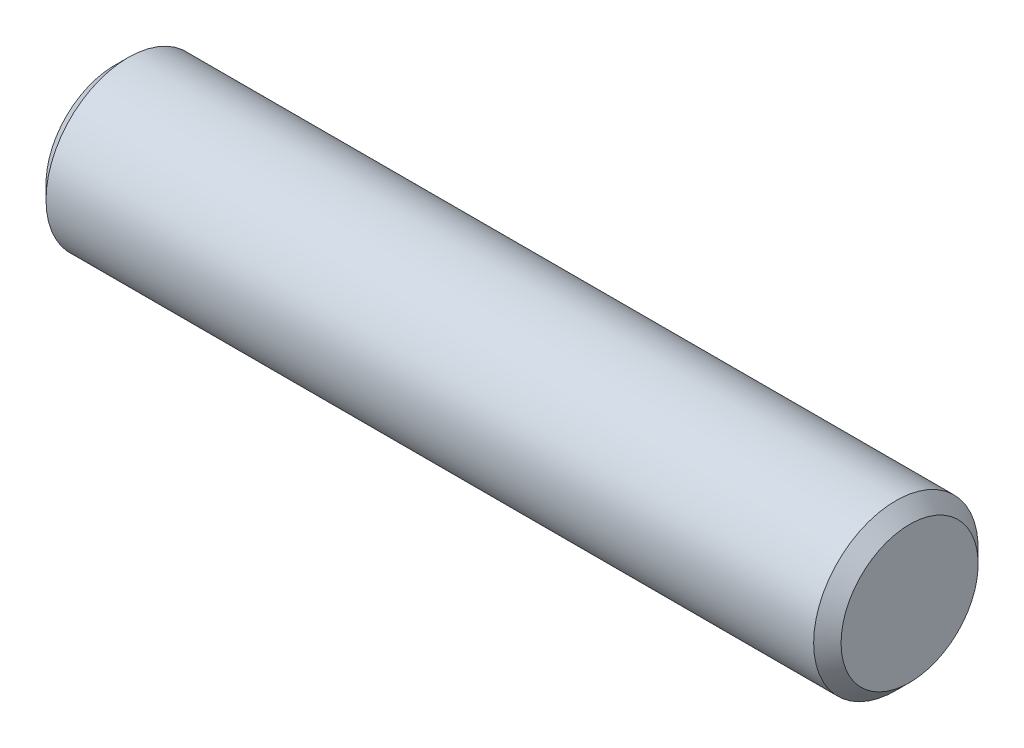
ISO-10303-21;
HEADER;
FILE_DESCRIPTION(('STEP AP214'),'2;1');
FILE_NAME('part.step','',(''),(''),'','','');
FILE_SCHEMA(('AUTOMOTIVE_DESIGN { 1 0 10303 214 1 1 1 1 }'));
ENDSEC;
DATA;
#1=APPLICATION_CONTEXT('core data for automotive mechanical design processes');
#2=APPLICATION_PROTOCOL_DEFINITION('international standard','automotive_design',2000,#1);
#3=PRODUCT_CONTEXT('',#1,'mechanical');
#4=PRODUCT('Part','Part','',(#3));
#5=PRODUCT_RELATED_PRODUCT_CATEGORY('part','',(#4));
#6=PRODUCT_DEFINITION_FORMATION('','',#4);
#7=PRODUCT_DEFINITION_CONTEXT('part definition',#1,'design');
#8=PRODUCT_DEFINITION('design','',#6,#7);
#9=PRODUCT_DEFINITION_SHAPE('','',#8);
#10=(LENGTH_UNIT() NAMED_UNIT(*) SI_UNIT(.MILLI.,.METRE.));
#11=(NAMED_UNIT(*) PLANE_ANGLE_UNIT() SI_UNIT($,.RADIAN.));
#12=(NAMED_UNIT(*) SI_UNIT($,.STERADIAN.) SOLID_ANGLE_UNIT());
#13=UNCERTAINTY_MEASURE_WITH_UNIT(LENGTH_MEASURE(1.E-05),#10,'distance_accuracy_value','');
#14=(GEOMETRIC_REPRESENTATION_CONTEXT(3) GLOBAL_UNCERTAINTY_ASSIGNED_CONTEXT((#13)) GLOBAL_UNIT_ASSIGNED_CONTEXT((#10,
#11,#12)) REPRESENTATION_CONTEXT('',''));
#15=CARTESIAN_POINT('',(0.,0.,0.));
#16=DIRECTION('',(0.,0.,1.));
#17=DIRECTION('',(1.,0.,0.));
#18=AXIS2_PLACEMENT_3D('',#15,#16,#17);
#19=CARTESIAN_POINT('',(8.67811660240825,14.1534057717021,6.66133814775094E-13));
#20=DIRECTION('',(-1.,0.,0.));
#21=DIRECTION('',(0.,0.,0.999999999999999));
#22=AXIS2_PLACEMENT_3D('',#19,#20,#21);
#23=PLANE('',#22);
#24=CARTESIAN_POINT('',(8.67811660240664,11.1534057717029,-2.22044604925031E-13));
#25=DIRECTION('',(-1.,0.,0.));
#26=DIRECTION('',(0.,0.,0.999999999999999));
#27=AXIS2_PLACEMENT_3D('',#24,#25,#26);
#28=CIRCLE('',#27,2.49999999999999);
#29=CARTESIAN_POINT('',(8.67811660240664,11.1534057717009,2.50000000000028));
#30=VERTEX_POINT('',#29);
#31=EDGE_CURVE('E40',#30,#30,#28,.F.);
#32=ORIENTED_EDGE('',*,*,#31,.T.);
#33=EDGE_LOOP('',(#32));
#34=FACE_BOUND('',#33,.T.);
#35=ADVANCED_FACE('F34',(#34),#23,.F.);
#36=CARTESIAN_POINT('',(-42.2506133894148,11.1534057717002,1.99840144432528E-12));
#37=DIRECTION('',(-1.,0.,0.));
#38=DIRECTION('',(0.,0.,0.999999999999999));
#39=AXIS2_PLACEMENT_3D('',#36,#37,#38);
#40=CYLINDRICAL_SURFACE('',#39,3.);
#41=CARTESIAN_POINT('',(8.17811660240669,11.1534057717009,2.22044604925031E-13));
#42=DIRECTION('',(-1.,0.,0.));
#43=DIRECTION('',(0.,0.,0.999999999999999));
#44=AXIS2_PLACEMENT_3D('',#41,#42,#43);
#45=CIRCLE('',#44,3.);
#46=CARTESIAN_POINT('',(8.17811660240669,11.1534057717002,3.000000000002));
#47=VERTEX_POINT('',#46);
#48=EDGE_CURVE('E44',#47,#47,#45,.T.);
#49=CARTESIAN_POINT('',(-19.8218833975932,11.153405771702,2.22044604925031E-13));
#50=DIRECTION('',(1.,0.,0.));
#51=DIRECTION('',(0.,0.,-0.999999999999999));
#52=AXIS2_PLACEMENT_3D('',#49,#50,#51);
#53=CIRCLE('',#52,3.);
#54=CARTESIAN_POINT('',(-19.8218833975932,11.1534057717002,3.000000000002));
#55=VERTEX_POINT('',#54);
#56=EDGE_CURVE('E48',#55,#55,#53,.T.);
#57=CARTESIAN_POINT('',(8.17811660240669,11.1534057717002,3.000000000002));
#58=CARTESIAN_POINT('',(7.88644993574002,11.1534057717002,3.000000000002));
#59=CARTESIAN_POINT('',(7.59478326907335,11.1534057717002,3.000000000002));
#60=CARTESIAN_POINT('',(7.01144993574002,11.1534057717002,3.000000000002));
#61=CARTESIAN_POINT('',(6.71978326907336,11.1534057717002,3.000000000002));
#62=CARTESIAN_POINT('',(6.13644993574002,11.1534057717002,3.000000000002));
#63=CARTESIAN_POINT('',(5.84478326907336,11.1534057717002,3.000000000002));
#64=CARTESIAN_POINT('',(5.26144993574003,11.1534057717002,3.000000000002));
#65=CARTESIAN_POINT('',(4.96978326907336,11.1534057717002,3.000000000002));
#66=CARTESIAN_POINT('',(4.38644993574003,11.1534057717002,3.000000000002));
#67=CARTESIAN_POINT('',(4.09478326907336,11.1534057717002,3.000000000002));
#68=CARTESIAN_POINT('',(3.51144993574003,11.1534057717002,3.000000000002));
#69=CARTESIAN_POINT('',(3.21978326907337,11.1534057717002,3.000000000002));
#70=CARTESIAN_POINT('',(2.63644993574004,11.1534057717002,3.000000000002));
#71=CARTESIAN_POINT('',(2.34478326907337,11.1534057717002,3.000000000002));
#72=CARTESIAN_POINT('',(1.76144993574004,11.1534057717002,3.000000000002));
#73=CARTESIAN_POINT('',(1.46978326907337,11.1534057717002,3.000000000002));
#74=CARTESIAN_POINT('',(0.886449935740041,11.1534057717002,3.000000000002));
#75=CARTESIAN_POINT('',(0.594783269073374,11.1534057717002,3.000000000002));
#76=CARTESIAN_POINT('',(0.0114499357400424,11.1534057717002,3.000000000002));
#77=CARTESIAN_POINT('',(-0.280216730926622,11.1534057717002,3.000000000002));
#78=CARTESIAN_POINT('',(-0.863550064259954,11.1534057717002,3.000000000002));
#79=CARTESIAN_POINT('',(-1.15521673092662,11.1534057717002,3.000000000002));
#80=CARTESIAN_POINT('',(-1.73855006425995,11.1534057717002,3.000000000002));
#81=CARTESIAN_POINT('',(-2.03021673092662,11.1534057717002,3.000000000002));
#82=CARTESIAN_POINT('',(-2.61355006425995,11.1534057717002,3.000000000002));
#83=CARTESIAN_POINT('',(-2.90521673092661,11.1534057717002,3.000000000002));
#84=CARTESIAN_POINT('',(-3.48855006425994,11.1534057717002,3.000000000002));
#85=CARTESIAN_POINT('',(-3.78021673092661,11.1534057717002,3.000000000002));
#86=CARTESIAN_POINT('',(-4.36355006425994,11.1534057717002,3.000000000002));
#87=CARTESIAN_POINT('',(-4.6552167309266,11.1534057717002,3.000000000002));
#88=CARTESIAN_POINT('',(-5.23855006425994,11.1534057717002,3.000000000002));
#89=CARTESIAN_POINT('',(-5.5302167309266,11.1534057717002,3.000000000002));
#90=CARTESIAN_POINT('',(-6.11355006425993,11.1534057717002,3.000000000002));
#91=CARTESIAN_POINT('',(-6.4052167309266,11.1534057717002,3.000000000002));
#92=CARTESIAN_POINT('',(-6.98855006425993,11.1534057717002,3.000000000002));
#93=CARTESIAN_POINT('',(-7.2802167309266,11.1534057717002,3.000000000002));
#94=CARTESIAN_POINT('',(-7.86355006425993,11.1534057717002,3.000000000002));
#95=CARTESIAN_POINT('',(-8.1552167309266,11.1534057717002,3.000000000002));
#96=CARTESIAN_POINT('',(-8.73855006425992,11.1534057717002,3.000000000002));
#97=CARTESIAN_POINT('',(-9.03021673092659,11.1534057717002,3.000000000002));
#98=CARTESIAN_POINT('',(-9.61355006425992,11.1534057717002,3.000000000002));
#99=CARTESIAN_POINT('',(-9.90521673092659,11.1534057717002,3.000000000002));
#100=CARTESIAN_POINT('',(-10.4885500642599,11.1534057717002,3.000000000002));
#101=CARTESIAN_POINT('',(-10.7802167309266,11.1534057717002,3.000000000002));
#102=CARTESIAN_POINT('',(-11.3635500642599,11.1534057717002,3.000000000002));
#103=CARTESIAN_POINT('',(-11.6552167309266,11.1534057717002,3.000000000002));
#104=CARTESIAN_POINT('',(-12.2385500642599,11.1534057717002,3.000000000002));
#105=CARTESIAN_POINT('',(-12.5302167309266,11.1534057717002,3.000000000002));
#106=CARTESIAN_POINT('',(-13.1135500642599,11.1534057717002,3.000000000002));
#107=CARTESIAN_POINT('',(-13.4052167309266,11.1534057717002,3.000000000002));
#108=CARTESIAN_POINT('',(-13.9885500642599,11.1534057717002,3.000000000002));
#109=CARTESIAN_POINT('',(-14.2802167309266,11.1534057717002,3.000000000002));
#110=CARTESIAN_POINT('',(-14.8635500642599,11.1534057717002,3.000000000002));
#111=CARTESIAN_POINT('',(-15.1552167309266,11.1534057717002,3.000000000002));
#112=CARTESIAN_POINT('',(-15.7385500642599,11.1534057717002,3.000000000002));
#113=CARTESIAN_POINT('',(-16.0302167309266,11.1534057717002,3.000000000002));
#114=CARTESIAN_POINT('',(-16.6135500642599,11.1534057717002,3.000000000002));
#115=CARTESIAN_POINT('',(-16.9052167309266,11.1534057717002,3.000000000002));
#116=CARTESIAN_POINT('',(-17.4885500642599,11.1534057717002,3.000000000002));
#117=CARTESIAN_POINT('',(-17.7802167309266,11.1534057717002,3.000000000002));
#118=CARTESIAN_POINT('',(-18.3635500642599,11.1534057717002,3.000000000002));
#119=CARTESIAN_POINT('',(-18.6552167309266,11.1534057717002,3.000000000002));
#120=CARTESIAN_POINT('',(-19.2385500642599,11.1534057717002,3.000000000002));
#121=CARTESIAN_POINT('',(-19.5302167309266,11.1534057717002,3.000000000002));
#122=CARTESIAN_POINT('',(-19.8218833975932,11.1534057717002,3.000000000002));
#123=B_SPLINE_CURVE_WITH_KNOTS('',3,(#57,#58,#59,#60,#61,#62,#63,#64,#65,#66,#67,#68,#69,#70,
#71,#72,#73,#74,#75,#76,#77,#78,#79,#80,#81,#82,#83,#84,#85,#86,#87,#88,#89,#90,#91,#92,#93,#94,
#95,#96,#97,#98,#99,#100,#101,#102,#103,#104,#105,#106,#107,#108,#109,#110,#111,#112,#113,#114,
#115,#116,#117,#118,#119,#120,#121,#122),.UNSPECIFIED.,.F.,.F.,(4,2,2,2,2,2,2,2,2,2,2,2,2,2,2,2,
2,2,2,2,2,2,2,2,2,2,2,2,2,2,2,2,4),(0.,0.875000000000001,1.74999999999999,2.625,
3.49999999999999,4.37499999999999,5.24999999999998,6.12499999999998,6.99999999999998,
7.87499999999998,8.74999999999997,9.62499999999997,10.5,11.375,12.25,13.125,14.,14.875,15.75,
16.6249999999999,17.4999999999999,18.3749999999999,19.2499999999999,20.1249999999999,
20.9999999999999,21.8749999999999,22.7499999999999,23.6249999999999,24.4999999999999,
25.3749999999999,26.2499999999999,27.1249999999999,27.9999999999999),.UNSPECIFIED.);
#124=EDGE_CURVE('BSEAM57',#47,#55,#123,.T.);
#125=ORIENTED_EDGE('',*,*,#48,.T.);
#126=ORIENTED_EDGE('',*,*,#56,.T.);
#127=ORIENTED_EDGE('',*,*,#124,.T.);
#128=ORIENTED_EDGE('',*,*,#124,.F.);
#129=EDGE_LOOP('',(#125,#127,#126,#128));
#130=FACE_BOUND('',#129,.T.);
#131=ADVANCED_FACE('F57',(#130),#40,.T.);
#132=CARTESIAN_POINT('',(-20.3218833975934,11.1534057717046,2.22044604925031E-12));
#133=DIRECTION('',(1.,0.,0.));
#134=DIRECTION('',(0.,0.,-0.999999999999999));
#135=AXIS2_PLACEMENT_3D('',#132,#133,#134);
#136=PLANE('',#135);
#137=CARTESIAN_POINT('',(-20.3218833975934,11.1534057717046,2.22044604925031E-12));
#138=DIRECTION('',(1.,0.,0.));
#139=DIRECTION('',(0.,0.,-0.999999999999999));
#140=AXIS2_PLACEMENT_3D('',#137,#138,#139);
#141=CIRCLE('',#140,2.50000000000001);
#142=CARTESIAN_POINT('',(-20.3218833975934,11.1534057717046,-2.49999999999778));
#143=VERTEX_POINT('',#142);
#144=EDGE_CURVE('E10',#143,#143,#141,.F.);
#145=ORIENTED_EDGE('',*,*,#144,.T.);
#146=EDGE_LOOP('',(#145));
#147=FACE_BOUND('',#146,.T.);
#148=ADVANCED_FACE('F67',(#147),#136,.F.);
#149=CARTESIAN_POINT('',(8.17811660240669,11.1534057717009,2.22044604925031E-13));
#150=DIRECTION('',(-1.,0.,0.));
#151=DIRECTION('',(0.,0.,0.999999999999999));
#152=AXIS2_PLACEMENT_3D('',#149,#150,#151);
#153=CONICAL_SURFACE('',#152,3.,0.785398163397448);
#154=CARTESIAN_POINT('',(8.67811660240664,11.1534057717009,2.50000000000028));
#155=CARTESIAN_POINT('',(8.67290826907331,11.1534057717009,2.50520833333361));
#156=CARTESIAN_POINT('',(8.66769993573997,11.1534057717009,2.51041666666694));
#157=CARTESIAN_POINT('',(8.65728326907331,11.1534057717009,2.52083333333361));
#158=CARTESIAN_POINT('',(8.65207493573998,11.1534057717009,2.52604166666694));
#159=CARTESIAN_POINT('',(8.64165826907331,11.1534057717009,2.5364583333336));
#160=CARTESIAN_POINT('',(8.63644993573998,11.1534057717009,2.54166666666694));
#161=CARTESIAN_POINT('',(8.62603326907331,11.1534057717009,2.5520833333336));
#162=CARTESIAN_POINT('',(8.62082493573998,11.1534057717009,2.55729166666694));
#163=CARTESIAN_POINT('',(8.61040826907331,11.1534057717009,2.5677083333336));
#164=CARTESIAN_POINT('',(8.60519993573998,11.1534057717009,2.57291666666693));
#165=CARTESIAN_POINT('',(8.59478326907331,11.1534057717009,2.5833333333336));
#166=CARTESIAN_POINT('',(8.58957493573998,11.1534057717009,2.58854166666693));
#167=CARTESIAN_POINT('',(8.57915826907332,11.1534057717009,2.5989583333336));
#168=CARTESIAN_POINT('',(8.57394993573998,11.1534057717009,2.60416666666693));
#169=CARTESIAN_POINT('',(8.56353326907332,11.1534057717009,2.6145833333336));
#170=CARTESIAN_POINT('',(8.55832493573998,11.1534057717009,2.61979166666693));
#171=CARTESIAN_POINT('',(8.54790826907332,11.1534057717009,2.63020833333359));
#172=CARTESIAN_POINT('',(8.54269993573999,11.1534057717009,2.63541666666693));
#173=CARTESIAN_POINT('',(8.53228326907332,11.1534057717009,2.64583333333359));
#174=CARTESIAN_POINT('',(8.52707493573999,11.1534057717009,2.65104166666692));
#175=CARTESIAN_POINT('',(8.51665826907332,11.1534057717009,2.66145833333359));
#176=CARTESIAN_POINT('',(8.51144993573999,11.1534057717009,2.66666666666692));
#177=CARTESIAN_POINT('',(8.50103326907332,11.1534057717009,2.67708333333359));
#178=CARTESIAN_POINT('',(8.49582493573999,11.1534057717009,2.68229166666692));
#179=CARTESIAN_POINT('',(8.48540826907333,11.1534057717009,2.69270833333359));
#180=CARTESIAN_POINT('',(8.48019993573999,11.1534057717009,2.69791666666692));
#181=CARTESIAN_POINT('',(8.46978326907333,11.1534057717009,2.70833333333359));
#182=CARTESIAN_POINT('',(8.46457493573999,11.1534057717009,2.71354166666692));
#183=CARTESIAN_POINT('',(8.45415826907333,11.1534057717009,2.72395833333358));
#184=CARTESIAN_POINT('',(8.44894993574,11.1534057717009,2.72916666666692));
#185=CARTESIAN_POINT('',(8.43853326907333,11.1534057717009,2.73958333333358));
#186=CARTESIAN_POINT('',(8.43332493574,11.1534057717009,2.74479166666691));
#187=CARTESIAN_POINT('',(8.42290826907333,11.1534057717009,2.75520833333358));
#188=CARTESIAN_POINT('',(8.41769993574,11.1534057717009,2.76041666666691));
#189=CARTESIAN_POINT('',(8.40728326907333,11.1534057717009,2.77083333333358));
#190=CARTESIAN_POINT('',(8.40207493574,11.1534057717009,2.77604166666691));
#191=CARTESIAN_POINT('',(8.39165826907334,11.1534057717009,2.78645833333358));
#192=CARTESIAN_POINT('',(8.38644993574,11.1534057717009,2.79166666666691));
#193=CARTESIAN_POINT('',(8.37603326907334,11.1534057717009,2.80208333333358));
#194=CARTESIAN_POINT('',(8.37082493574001,11.1534057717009,2.80729166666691));
#195=CARTESIAN_POINT('',(8.36040826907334,11.1534057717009,2.81770833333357));
#196=CARTESIAN_POINT('',(8.35519993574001,11.1534057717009,2.82291666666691));
#197=CARTESIAN_POINT('',(8.34478326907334,11.1534057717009,2.83333333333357));
#198=CARTESIAN_POINT('',(8.33957493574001,11.1534057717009,2.8385416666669));
#199=CARTESIAN_POINT('',(8.32915826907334,11.1534057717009,2.84895833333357));
#200=CARTESIAN_POINT('',(8.32394993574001,11.1534057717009,2.8541666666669));
#201=CARTESIAN_POINT('',(8.31353326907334,11.1534057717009,2.86458333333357));
#202=CARTESIAN_POINT('',(8.30832493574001,11.1534057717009,2.8697916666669));
#203=CARTESIAN_POINT('',(8.29790826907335,11.1534057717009,2.88020833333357));
#204=CARTESIAN_POINT('',(8.29269993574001,11.1534057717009,2.8854166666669));
#205=CARTESIAN_POINT('',(8.28228326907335,11.1534057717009,2.89583333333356));
#206=CARTESIAN_POINT('',(8.27707493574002,11.1534057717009,2.9010416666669));
#207=CARTESIAN_POINT('',(8.26665826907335,11.1534057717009,2.91145833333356));
#208=CARTESIAN_POINT('',(8.26144993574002,11.1534057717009,2.9166666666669));
#209=CARTESIAN_POINT('',(8.25103326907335,11.1534057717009,2.92708333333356));
#210=CARTESIAN_POINT('',(8.24582493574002,11.1534057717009,2.93229166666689));
#211=CARTESIAN_POINT('',(8.23540826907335,11.1534057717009,2.94270833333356));
#212=CARTESIAN_POINT('',(8.23019993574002,11.1534057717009,2.94791666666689));
#213=CARTESIAN_POINT('',(8.21978326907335,11.1534057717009,2.95833333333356));
#214=CARTESIAN_POINT('',(8.21457493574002,11.1534057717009,2.96354166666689));
#215=CARTESIAN_POINT('',(8.20415826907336,11.1534057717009,2.97395833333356));
#216=CARTESIAN_POINT('',(8.19894993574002,11.1534057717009,2.97916666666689));
#217=CARTESIAN_POINT('',(8.18853326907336,11.1534057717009,2.98958333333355));
#218=CARTESIAN_POINT('',(8.18332493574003,11.1534057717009,2.99479166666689));
#219=CARTESIAN_POINT('',(8.17811660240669,11.1534057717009,3.00000000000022));
#220=B_SPLINE_CURVE_WITH_KNOTS('',3,(#154,#155,#156,#157,#158,#159,#160,#161,#162,#163,#164,
#165,#166,#167,#168,#169,#170,#171,#172,#173,#174,#175,#176,#177,#178,#179,#180,#181,#182,#183,
#184,#185,#186,#187,#188,#189,#190,#191,#192,#193,#194,#195,#196,#197,#198,#199,#200,#201,#202,
#203,#204,#205,#206,#207,#208,#209,#210,#211,#212,#213,#214,#215,#216,#217,#218,#219),
.UNSPECIFIED.,.F.,.F.,(4,2,2,2,2,2,2,2,2,2,2,2,2,2,2,2,2,2,2,2,2,2,2,2,2,2,2,2,2,2,2,2,4),(0.,
0.0220970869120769,0.044194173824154,0.0662912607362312,0.0883883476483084,0.110485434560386,
0.132582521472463,0.15467960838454,0.176776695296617,0.198873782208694,0.220970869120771,
0.24306795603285,0.265165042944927,0.287262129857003,0.30935921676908,0.331456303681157,
0.353553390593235,0.375650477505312,0.397747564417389,0.419844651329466,0.441941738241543,
0.464038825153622,0.486135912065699,0.508232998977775,0.530330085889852,0.552427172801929,
0.574524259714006,0.596621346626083,0.618718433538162,0.640815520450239,0.662912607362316,
0.685009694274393,0.707106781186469),.UNSPECIFIED.);
#221=EDGE_CURVE('BSEAM62',#30,#47,#220,.T.);
#222=ORIENTED_EDGE('',*,*,#31,.F.);
#223=ORIENTED_EDGE('',*,*,#48,.F.);
#224=ORIENTED_EDGE('',*,*,#221,.T.);
#225=ORIENTED_EDGE('',*,*,#221,.F.);
#226=EDGE_LOOP('',(#222,#224,#223,#225));
#227=FACE_BOUND('',#226,.T.);
#228=ADVANCED_FACE('F62',(#227),#153,.T.);
#229=CARTESIAN_POINT('',(-20.3218833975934,11.1534057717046,2.22044604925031E-12));
#230=DIRECTION('',(1.,0.,0.));
#231=DIRECTION('',(0.,0.,-0.999999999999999));
#232=AXIS2_PLACEMENT_3D('',#229,#230,#231);
#233=CONICAL_SURFACE('',#232,2.50000000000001,0.785398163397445);
#234=ORIENTED_EDGE('',*,*,#56,.F.);
#235=EDGE_LOOP('',(#234));
#236=FACE_BOUND('',#235,.T.);
#237=ORIENTED_EDGE('',*,*,#144,.F.);
#238=EDGE_LOOP('',(#237));
#239=FACE_BOUND('',#238,.T.);
#240=ADVANCED_FACE('F59',(#236,#239),#233,.T.);
#241=CLOSED_SHELL('',(#35,#131,#148,#228,#240));
#242=MANIFOLD_SOLID_BREP('B2',#241);
#243=ADVANCED_BREP_SHAPE_REPRESENTATION('',(#18,#242),#14);
#244=SHAPE_DEFINITION_REPRESENTATION(#9,#243);
ENDSEC;
END-ISO-10303-21;
